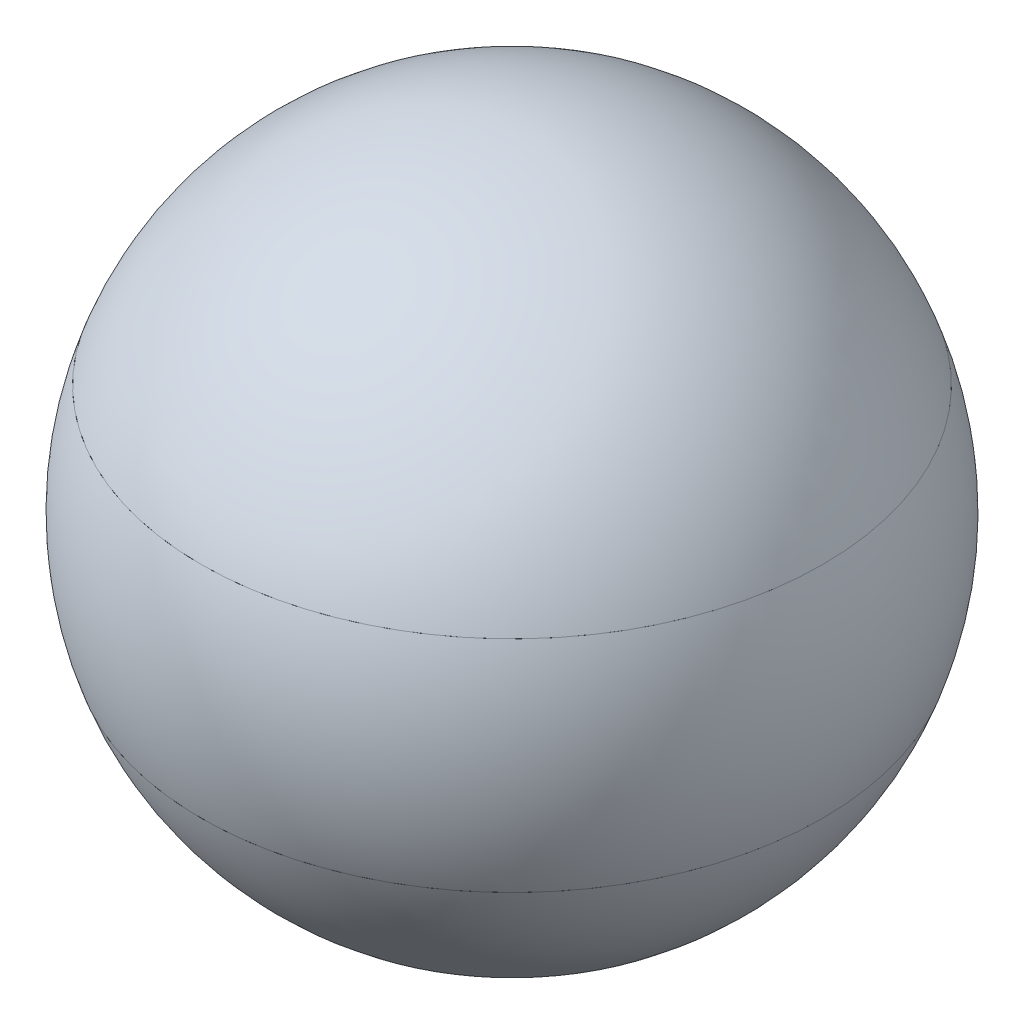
ISO-10303-21;
HEADER;
FILE_DESCRIPTION(('STEP AP214'),'2;1');
FILE_NAME('part.step','',(''),(''),'','','');
FILE_SCHEMA(('AUTOMOTIVE_DESIGN { 1 0 10303 214 1 1 1 1 }'));
ENDSEC;
DATA;
#1=APPLICATION_CONTEXT('core data for automotive mechanical design processes');
#2=APPLICATION_PROTOCOL_DEFINITION('international standard','automotive_design',2000,#1);
#3=PRODUCT_CONTEXT('',#1,'mechanical');
#4=PRODUCT('Part','Part','',(#3));
#5=PRODUCT_RELATED_PRODUCT_CATEGORY('part','',(#4));
#6=PRODUCT_DEFINITION_FORMATION('','',#4);
#7=PRODUCT_DEFINITION_CONTEXT('part definition',#1,'design');
#8=PRODUCT_DEFINITION('design','',#6,#7);
#9=PRODUCT_DEFINITION_SHAPE('','',#8);
#10=(LENGTH_UNIT() NAMED_UNIT(*) SI_UNIT(.MILLI.,.METRE.));
#11=(NAMED_UNIT(*) PLANE_ANGLE_UNIT() SI_UNIT($,.RADIAN.));
#12=(NAMED_UNIT(*) SI_UNIT($,.STERADIAN.) SOLID_ANGLE_UNIT());
#13=UNCERTAINTY_MEASURE_WITH_UNIT(LENGTH_MEASURE(1.E-05),#10,'distance_accuracy_value','');
#14=(GEOMETRIC_REPRESENTATION_CONTEXT(3) GLOBAL_UNCERTAINTY_ASSIGNED_CONTEXT((#13)) GLOBAL_UNIT_ASSIGNED_CONTEXT((#10,
#11,#12)) REPRESENTATION_CONTEXT('',''));
#15=CARTESIAN_POINT('',(0.,0.,0.));
#16=DIRECTION('',(0.,0.,1.));
#17=DIRECTION('',(1.,0.,0.));
#18=AXIS2_PLACEMENT_3D('',#15,#16,#17);
#19=CARTESIAN_POINT('',(0.,0.,0.));
#20=DIRECTION('',(0.,1.,0.));
#21=DIRECTION('',(1.,0.,0.));
#22=AXIS2_PLACEMENT_3D('',#19,#20,#21);
#23=SPHERICAL_SURFACE('',#22,50.);
#24=CARTESIAN_POINT('',(0.,-16.6666666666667,0.));
#25=DIRECTION('',(0.,1.,0.));
#26=DIRECTION('',(0.,0.,1.));
#27=AXIS2_PLACEMENT_3D('',#24,#25,#26);
#28=CIRCLE('',#27,47.1404520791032);
#29=CARTESIAN_POINT('',(0.,-16.6666666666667,47.1404520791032));
#30=VERTEX_POINT('',#29);
#31=EDGE_CURVE('E11',#30,#30,#28,.T.);
#32=ORIENTED_EDGE('',*,*,#31,.F.);
#33=EDGE_LOOP('',(#32));
#34=FACE_BOUND('',#33,.T.);
#35=ADVANCED_FACE('F42',(#34),#23,.T.);
#36=CARTESIAN_POINT('',(25.,-16.6666666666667,0.));
#37=DIRECTION('',(0.,1.,0.));
#38=DIRECTION('',(0.,0.,1.));
#39=AXIS2_PLACEMENT_3D('',#36,#37,#38);
#40=PLANE('',#39);
#41=ORIENTED_EDGE('',*,*,#31,.T.);
#42=EDGE_LOOP('',(#41));
#43=FACE_BOUND('',#42,.T.);
#44=ADVANCED_FACE('F49',(#43),#40,.T.);
#45=CLOSED_SHELL('',(#35,#44));
#46=MANIFOLD_SOLID_BREP('B2',#45);
#47=CARTESIAN_POINT('',(25.,-16.6666666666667,0.));
#48=DIRECTION('',(0.,1.,0.));
#49=DIRECTION('',(0.,0.,1.));
#50=AXIS2_PLACEMENT_3D('',#47,#48,#49);
#51=PLANE('',#50);
#52=CARTESIAN_POINT('',(0.,-16.6666666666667,0.));
#53=DIRECTION('',(0.,1.,0.));
#54=DIRECTION('',(0.,0.,1.));
#55=AXIS2_PLACEMENT_3D('',#52,#53,#54);
#56=CIRCLE('',#55,47.1404520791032);
#57=CARTESIAN_POINT('',(47.1404520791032,-16.6666666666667,0.));
#58=VERTEX_POINT('',#57);
#59=EDGE_CURVE('E41',#58,#58,#56,.T.);
#60=ORIENTED_EDGE('',*,*,#59,.F.);
#61=EDGE_LOOP('',(#60));
#62=FACE_BOUND('',#61,.T.);
#63=ADVANCED_FACE('F75',(#62),#51,.F.);
#64=CARTESIAN_POINT('',(0.,0.,0.));
#65=DIRECTION('',(0.,1.,0.));
#66=DIRECTION('',(1.,0.,0.));
#67=AXIS2_PLACEMENT_3D('',#64,#65,#66);
#68=SPHERICAL_SURFACE('',#67,50.);
#69=CARTESIAN_POINT('',(0.,16.6666666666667,0.));
#70=DIRECTION('',(0.,1.,0.));
#71=DIRECTION('',(0.,0.,1.));
#72=AXIS2_PLACEMENT_3D('',#69,#70,#71);
#73=CIRCLE('',#72,47.1404520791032);
#74=CARTESIAN_POINT('',(47.1404520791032,16.6666666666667,0.));
#75=VERTEX_POINT('',#74);
#76=EDGE_CURVE('E81',#75,#75,#73,.T.);
#77=CARTESIAN_POINT('',(47.1404520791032,16.6666666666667,0.));
#78=CARTESIAN_POINT('',(47.2584515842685,16.3329154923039,0.));
#79=CARTESIAN_POINT('',(47.372905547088,15.9979108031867,0.));
#80=CARTESIAN_POINT('',(47.5946732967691,15.3255463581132,0.));
#81=CARTESIAN_POINT('',(47.7019870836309,14.9881866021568,0.));
#82=CARTESIAN_POINT('',(47.9094253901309,14.3112639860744,0.));
#83=CARTESIAN_POINT('',(48.0095499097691,13.9717011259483,0.));
#84=CARTESIAN_POINT('',(48.2025646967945,13.2905255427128,0.));
#85=CARTESIAN_POINT('',(48.2954549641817,12.9489128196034,0.));
#86=CARTESIAN_POINT('',(48.4739592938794,12.2637916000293,0.));
#87=CARTESIAN_POINT('',(48.5595733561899,11.9202831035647,0.));
#88=CARTESIAN_POINT('',(48.7234866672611,11.2315253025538,0.));
#89=CARTESIAN_POINT('',(48.8017859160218,10.8862759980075,0.));
#90=CARTESIAN_POINT('',(48.9510342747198,10.1941923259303,0.));
#91=CARTESIAN_POINT('',(49.0219833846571,9.84735795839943,0.));
#92=CARTESIAN_POINT('',(49.1564994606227,9.15226062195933,0.));
#93=CARTESIAN_POINT('',(49.220066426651,8.80399765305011,0.));
#94=CARTESIAN_POINT('',(49.3397895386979,8.10620021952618,0.));
#95=CARTESIAN_POINT('',(49.3959456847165,7.75666575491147,0.));
#96=CARTESIAN_POINT('',(49.5008218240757,7.05648300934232,0.));
#97=CARTESIAN_POINT('',(49.5495418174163,6.70583472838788,0.));
#98=CARTESIAN_POINT('',(49.6395236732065,6.00358253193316,0.));
#99=CARTESIAN_POINT('',(49.6807855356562,5.65197861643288,0.));
#100=CARTESIAN_POINT('',(49.7558325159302,4.94797376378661,0.));
#101=CARTESIAN_POINT('',(49.7896176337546,4.59557282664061,0.));
#102=CARTESIAN_POINT('',(49.8496958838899,3.89013290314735,0.));
#103=CARTESIAN_POINT('',(49.8759890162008,3.53709391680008,0.));
#104=CARTESIAN_POINT('',(49.9210714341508,2.83053715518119,0.));
#105=CARTESIAN_POINT('',(49.9398607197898,2.47701937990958,0.));
#106=CARTESIAN_POINT('',(49.9699269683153,1.76966451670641,0.));
#107=CARTESIAN_POINT('',(49.9812039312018,1.41582742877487,0.));
#108=CARTESIAN_POINT('',(49.9962404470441,0.707993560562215,0.));
#109=CARTESIAN_POINT('',(50.,0.353996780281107,0.));
#110=CARTESIAN_POINT('',(50.,-0.353996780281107,0.));
#111=CARTESIAN_POINT('',(49.9962404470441,-0.707993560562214,0.));
#112=CARTESIAN_POINT('',(49.9812039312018,-1.41582742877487,0.));
#113=CARTESIAN_POINT('',(49.9699269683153,-1.76966451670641,0.));
#114=CARTESIAN_POINT('',(49.9398607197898,-2.47701937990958,0.));
#115=CARTESIAN_POINT('',(49.9210714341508,-2.83053715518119,0.));
#116=CARTESIAN_POINT('',(49.8759890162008,-3.53709391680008,0.));
#117=CARTESIAN_POINT('',(49.8496958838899,-3.89013290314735,0.));
#118=CARTESIAN_POINT('',(49.7896176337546,-4.59557282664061,0.));
#119=CARTESIAN_POINT('',(49.7558325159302,-4.94797376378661,0.));
#120=CARTESIAN_POINT('',(49.6807855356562,-5.65197861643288,0.));
#121=CARTESIAN_POINT('',(49.6395236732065,-6.00358253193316,0.));
#122=CARTESIAN_POINT('',(49.5495418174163,-6.70583472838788,0.));
#123=CARTESIAN_POINT('',(49.5008218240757,-7.05648300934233,0.));
#124=CARTESIAN_POINT('',(49.3959456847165,-7.75666575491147,0.));
#125=CARTESIAN_POINT('',(49.3397895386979,-8.10620021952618,0.));
#126=CARTESIAN_POINT('',(49.220066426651,-8.8039976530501,0.));
#127=CARTESIAN_POINT('',(49.1564994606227,-9.15226062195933,0.));
#128=CARTESIAN_POINT('',(49.0219833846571,-9.84735795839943,0.));
#129=CARTESIAN_POINT('',(48.9510342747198,-10.1941923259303,0.));
#130=CARTESIAN_POINT('',(48.8017859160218,-10.8862759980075,0.));
#131=CARTESIAN_POINT('',(48.7234866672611,-11.2315253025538,0.));
#132=CARTESIAN_POINT('',(48.5595733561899,-11.9202831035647,0.));
#133=CARTESIAN_POINT('',(48.4739592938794,-12.2637916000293,0.));
#134=CARTESIAN_POINT('',(48.2954549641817,-12.9489128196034,0.));
#135=CARTESIAN_POINT('',(48.2025646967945,-13.2905255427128,0.));
#136=CARTESIAN_POINT('',(48.0095499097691,-13.9717011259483,0.));
#137=CARTESIAN_POINT('',(47.9094253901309,-14.3112639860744,0.));
#138=CARTESIAN_POINT('',(47.7019870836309,-14.9881866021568,0.));
#139=CARTESIAN_POINT('',(47.5946732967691,-15.3255463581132,0.));
#140=CARTESIAN_POINT('',(47.372905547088,-15.9979108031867,0.));
#141=CARTESIAN_POINT('',(47.2584515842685,-16.3329154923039,0.));
#142=CARTESIAN_POINT('',(47.1404520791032,-16.6666666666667,0.));
#143=B_SPLINE_CURVE_WITH_KNOTS('',3,(#77,#78,#79,#80,#81,#82,#83,#84,#85,#86,#87,#88,#89,#90,
#91,#92,#93,#94,#95,#96,#97,#98,#99,#100,#101,#102,#103,#104,#105,#106,#107,#108,#109,#110,#111,
#112,#113,#114,#115,#116,#117,#118,#119,#120,#121,#122,#123,#124,#125,#126,#127,#128,#129,#130,
#131,#132,#133,#134,#135,#136,#137,#138,#139,#140,#141,#142),.UNSPECIFIED.,.F.,.F.,(4,2,2,2,2,2,
2,2,2,2,2,2,2,2,2,2,2,2,2,2,2,2,2,2,2,2,2,2,2,2,2,2,4),(0.,1.06197037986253,2.12394075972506,
3.18591113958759,4.24788151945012,5.30985189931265,6.37182227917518,7.43379265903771,
8.49576303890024,9.55773341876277,10.6197037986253,11.6816741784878,12.7436445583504,
13.8056149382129,14.8675853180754,15.9295556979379,16.9915260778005,18.053496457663,
19.1154668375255,20.1774372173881,21.2394075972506,22.3013779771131,23.3633483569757,
24.4253187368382,25.4872891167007,26.5492594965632,27.6112298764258,28.6732002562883,
29.7351706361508,30.7971410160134,31.8591113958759,32.9210817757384,33.983052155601),.UNSPECIFIED.);
#144=EDGE_CURVE('BSEAM89',#75,#58,#143,.T.);
#145=ORIENTED_EDGE('',*,*,#76,.F.);
#146=ORIENTED_EDGE('',*,*,#59,.T.);
#147=ORIENTED_EDGE('',*,*,#144,.T.);
#148=ORIENTED_EDGE('',*,*,#144,.F.);
#149=EDGE_LOOP('',(#145,#147,#146,#148));
#150=FACE_BOUND('',#149,.T.);
#151=ADVANCED_FACE('F89',(#150),#68,.T.);
#152=CARTESIAN_POINT('',(25.,16.6666666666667,0.));
#153=DIRECTION('',(0.,1.,0.));
#154=DIRECTION('',(0.,0.,1.));
#155=AXIS2_PLACEMENT_3D('',#152,#153,#154);
#156=PLANE('',#155);
#157=ORIENTED_EDGE('',*,*,#76,.T.);
#158=EDGE_LOOP('',(#157));
#159=FACE_BOUND('',#158,.T.);
#160=ADVANCED_FACE('F87',(#159),#156,.T.);
#161=CLOSED_SHELL('',(#63,#151,#160));
#162=MANIFOLD_SOLID_BREP('B6',#161);
#163=CARTESIAN_POINT('',(25.,16.6666666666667,0.));
#164=DIRECTION('',(0.,1.,0.));
#165=DIRECTION('',(0.,0.,1.));
#166=AXIS2_PLACEMENT_3D('',#163,#164,#165);
#167=PLANE('',#166);
#168=CARTESIAN_POINT('',(0.,16.6666666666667,0.));
#169=DIRECTION('',(0.,1.,0.));
#170=DIRECTION('',(0.,0.,1.));
#171=AXIS2_PLACEMENT_3D('',#168,#169,#170);
#172=CIRCLE('',#171,47.1404520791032);
#173=CARTESIAN_POINT('',(0.,16.6666666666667,47.1404520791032));
#174=VERTEX_POINT('',#173);
#175=EDGE_CURVE('E74',#174,#174,#172,.T.);
#176=ORIENTED_EDGE('',*,*,#175,.F.);
#177=EDGE_LOOP('',(#176));
#178=FACE_BOUND('',#177,.T.);
#179=ADVANCED_FACE('F116',(#178),#167,.F.);
#180=CARTESIAN_POINT('',(0.,0.,0.));
#181=DIRECTION('',(0.,1.,0.));
#182=DIRECTION('',(1.,0.,0.));
#183=AXIS2_PLACEMENT_3D('',#180,#181,#182);
#184=SPHERICAL_SURFACE('',#183,50.);
#185=ORIENTED_EDGE('',*,*,#175,.T.);
#186=EDGE_LOOP('',(#185));
#187=FACE_BOUND('',#186,.T.);
#188=ADVANCED_FACE('F123',(#187),#184,.T.);
#189=CLOSED_SHELL('',(#179,#188));
#190=MANIFOLD_SOLID_BREP('B36',#189);
#191=ADVANCED_BREP_SHAPE_REPRESENTATION('',(#18,#46,#162,#190),#14);
#192=SHAPE_DEFINITION_REPRESENTATION(#9,#191);
ENDSEC;
END-ISO-10303-21;
